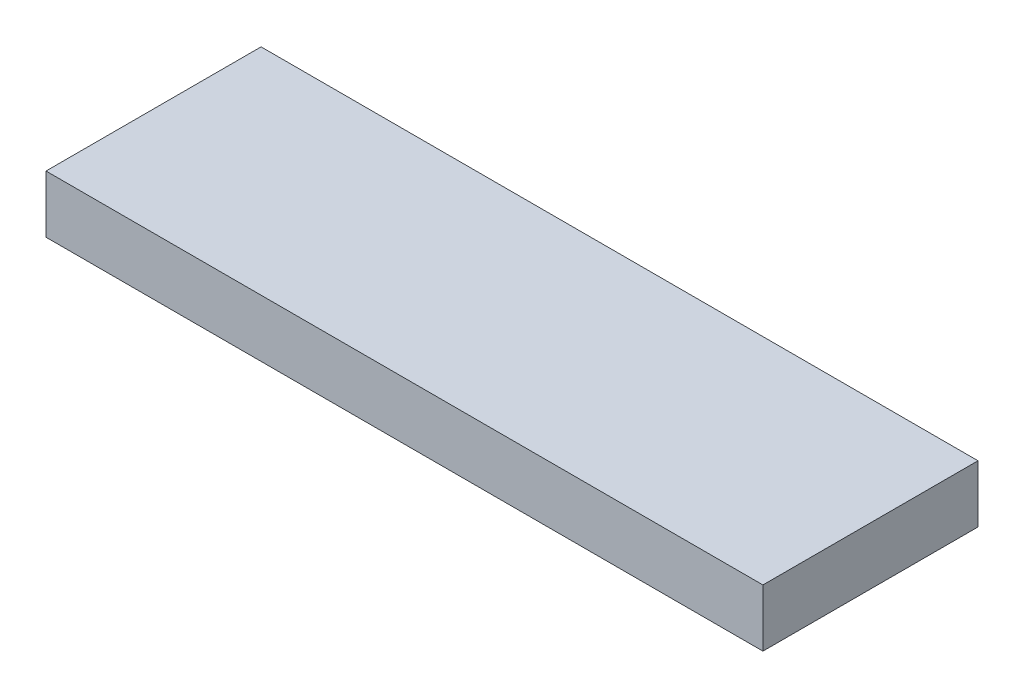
from build123d import *

# Parameters (mm, degrees)
SKETCH1_W           = 100
SKETCH1_H           = 30
BOSS_EXTRUDE1_DEPTH = 4


with BuildPart() as part:
    # Sketch1 → Boss-Extrude1 (new, symmetric)
    with BuildSketch(Plane(origin=(0, 0, 0), x_dir=(1, 0, 0), z_dir=(0, 1, 0))):
        Rectangle(SKETCH1_W, SKETCH1_H)
    extrude(amount=BOSS_EXTRUDE1_DEPTH, both=True)


solid = part.part
